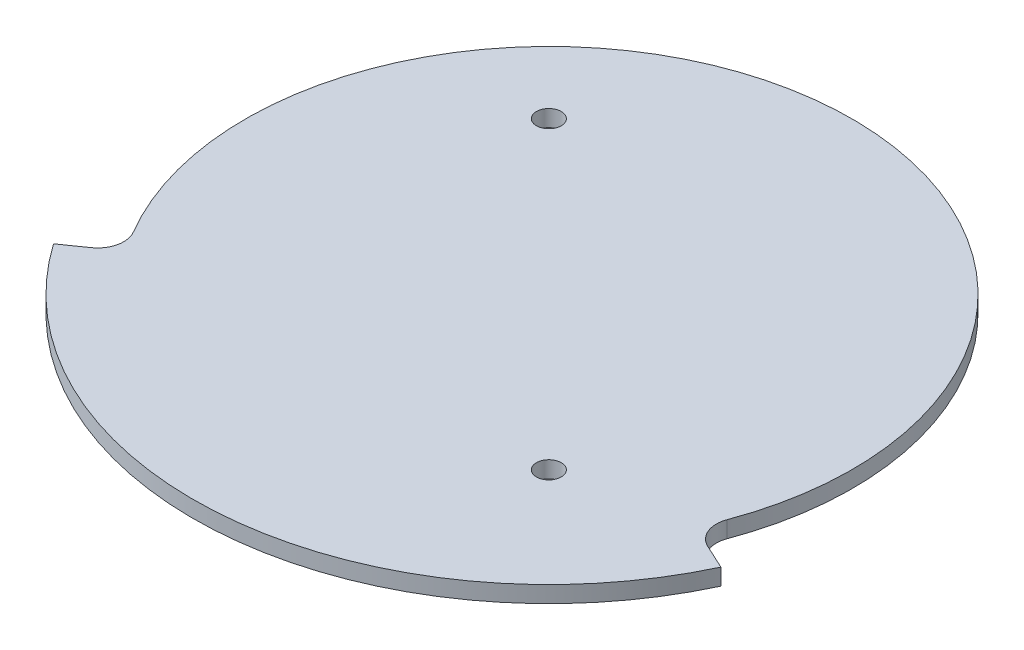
ISO-10303-21;
HEADER;
FILE_DESCRIPTION(('STEP AP214'),'2;1');
FILE_NAME('part.step','',(''),(''),'','','');
FILE_SCHEMA(('AUTOMOTIVE_DESIGN { 1 0 10303 214 1 1 1 1 }'));
ENDSEC;
DATA;
#1=APPLICATION_CONTEXT('core data for automotive mechanical design processes');
#2=APPLICATION_PROTOCOL_DEFINITION('international standard','automotive_design',2000,#1);
#3=PRODUCT_CONTEXT('',#1,'mechanical');
#4=PRODUCT('Part','Part','',(#3));
#5=PRODUCT_RELATED_PRODUCT_CATEGORY('part','',(#4));
#6=PRODUCT_DEFINITION_FORMATION('','',#4);
#7=PRODUCT_DEFINITION_CONTEXT('part definition',#1,'design');
#8=PRODUCT_DEFINITION('design','',#6,#7);
#9=PRODUCT_DEFINITION_SHAPE('','',#8);
#10=(LENGTH_UNIT() NAMED_UNIT(*) SI_UNIT(.MILLI.,.METRE.));
#11=(NAMED_UNIT(*) PLANE_ANGLE_UNIT() SI_UNIT($,.RADIAN.));
#12=(NAMED_UNIT(*) SI_UNIT($,.STERADIAN.) SOLID_ANGLE_UNIT());
#13=UNCERTAINTY_MEASURE_WITH_UNIT(LENGTH_MEASURE(1.E-05),#10,'distance_accuracy_value','');
#14=(GEOMETRIC_REPRESENTATION_CONTEXT(3) GLOBAL_UNCERTAINTY_ASSIGNED_CONTEXT((#13)) GLOBAL_UNIT_ASSIGNED_CONTEXT((#10,
#11,#12)) REPRESENTATION_CONTEXT('',''));
#15=CARTESIAN_POINT('',(0.,0.,0.));
#16=DIRECTION('',(0.,0.,1.));
#17=DIRECTION('',(1.,0.,0.));
#18=AXIS2_PLACEMENT_3D('',#15,#16,#17);
#19=CARTESIAN_POINT('',(0.,6.35,0.));
#20=DIRECTION('',(0.,-1.,0.));
#21=DIRECTION('',(0.,0.,-1.));
#22=AXIS2_PLACEMENT_3D('',#19,#20,#21);
#23=CYLINDRICAL_SURFACE('',#22,136.5);
#24=CARTESIAN_POINT('',(0.,0.,0.));
#25=DIRECTION('',(0.,1.,0.));
#26=DIRECTION('',(0.,0.,1.));
#27=AXIS2_PLACEMENT_3D('',#24,#25,#26);
#28=CIRCLE('',#27,136.5);
#29=CARTESIAN_POINT('',(-111.814254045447,0.,78.293183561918));
#30=VERTEX_POINT('',#29);
#31=CARTESIAN_POINT('',(123.711012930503,0.,57.6873927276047));
#32=VERTEX_POINT('',#31);
#33=EDGE_CURVE('E38',#30,#32,#28,.T.);
#34=ORIENTED_EDGE('',*,*,#33,.T.);
#35=DIRECTION('',(0.,1.,0.));
#36=VECTOR('',#35,1.);
#37=CARTESIAN_POINT('',(123.711012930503,0.,57.6873927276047));
#38=LINE('',#37,#36);
#39=CARTESIAN_POINT('',(123.711012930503,6.35,57.6873927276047));
#40=VERTEX_POINT('',#39);
#41=EDGE_CURVE('E59',#32,#40,#38,.T.);
#42=ORIENTED_EDGE('',*,*,#41,.T.);
#43=CARTESIAN_POINT('',(0.,6.35,0.));
#44=DIRECTION('',(0.,1.,0.));
#45=DIRECTION('',(0.,0.,1.));
#46=AXIS2_PLACEMENT_3D('',#43,#44,#45);
#47=CIRCLE('',#46,136.5);
#48=CARTESIAN_POINT('',(-111.814254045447,6.35,78.293183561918));
#49=VERTEX_POINT('',#48);
#50=EDGE_CURVE('E11',#49,#40,#47,.T.);
#51=ORIENTED_EDGE('',*,*,#50,.F.);
#52=DIRECTION('',(0.,1.,0.));
#53=VECTOR('',#52,1.);
#54=CARTESIAN_POINT('',(-111.814254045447,0.,78.293183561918));
#55=LINE('',#54,#53);
#56=EDGE_CURVE('E120',#30,#49,#55,.T.);
#57=ORIENTED_EDGE('',*,*,#56,.F.);
#58=EDGE_LOOP('',(#34,#42,#51,#57));
#59=FACE_BOUND('',#58,.T.);
#60=ADVANCED_FACE('F35',(#59),#23,.T.);
#61=CARTESIAN_POINT('',(0.,6.35,0.));
#62=DIRECTION('',(0.,1.,0.));
#63=DIRECTION('',(0.,0.,1.));
#64=AXIS2_PLACEMENT_3D('',#61,#62,#63);
#65=PLANE('',#64);
#66=CARTESIAN_POINT('',(-58.3716647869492,6.35,-58.3716647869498));
#67=DIRECTION('',(0.,1.,0.));
#68=DIRECTION('',(0.,0.,1.));
#69=AXIS2_PLACEMENT_3D('',#66,#67,#68);
#70=CIRCLE('',#69,4.76249999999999);
#71=CARTESIAN_POINT('',(-58.3716647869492,6.35,-53.6091647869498));
#72=VERTEX_POINT('',#71);
#73=EDGE_CURVE('E251',#72,#72,#70,.T.);
#74=ORIENTED_EDGE('',*,*,#73,.F.);
#75=EDGE_LOOP('',(#74));
#76=FACE_BOUND('',#75,.T.);
#77=CARTESIAN_POINT('',(58.3716647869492,6.35,58.3716647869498));
#78=DIRECTION('',(0.,1.,0.));
#79=DIRECTION('',(0.,0.,1.));
#80=AXIS2_PLACEMENT_3D('',#77,#78,#79);
#81=CIRCLE('',#80,4.76249999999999);
#82=CARTESIAN_POINT('',(58.3716647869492,6.35,63.1341647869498));
#83=VERTEX_POINT('',#82);
#84=EDGE_CURVE('E240',#83,#83,#81,.T.);
#85=ORIENTED_EDGE('',*,*,#84,.F.);
#86=EDGE_LOOP('',(#85));
#87=FACE_BOUND('',#86,.T.);
#88=DIRECTION('',(0.906307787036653,0.,0.422618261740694));
#89=VECTOR('',#88,1.);
#90=CARTESIAN_POINT('',(114.289149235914,6.35,53.2939055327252));
#91=LINE('',#90,#89);
#92=CARTESIAN_POINT('',(114.289149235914,6.35,53.2939055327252));
#93=VERTEX_POINT('',#92);
#94=EDGE_CURVE('E82',#93,#40,#91,.T.);
#95=ORIENTED_EDGE('',*,*,#94,.F.);
#96=CARTESIAN_POINT('',(118.515331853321,6.35,44.2308276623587));
#97=DIRECTION('',(0.,1.,0.));
#98=DIRECTION('',(0.,0.,1.));
#99=AXIS2_PLACEMENT_3D('',#96,#97,#98);
#100=CIRCLE('',#99,10.);
#101=CARTESIAN_POINT('',(109.146530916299,6.35,40.7343195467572));
#102=VERTEX_POINT('',#101);
#103=EDGE_CURVE('E129',#102,#93,#100,.T.);
#104=ORIENTED_EDGE('',*,*,#103,.F.);
#105=CARTESIAN_POINT('',(0.,6.35,0.));
#106=DIRECTION('',(0.,-1.,0.));
#107=DIRECTION('',(0.,0.,1.));
#108=AXIS2_PLACEMENT_3D('',#105,#106,#107);
#109=CIRCLE('',#108,116.5);
#110=CARTESIAN_POINT('',(-100.414909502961,6.35,59.0685698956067));
#111=VERTEX_POINT('',#110);
#112=EDGE_CURVE('E101',#111,#102,#109,.T.);
#113=ORIENTED_EDGE('',*,*,#112,.F.);
#114=CARTESIAN_POINT('',(-109.034215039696,6.35,64.1388334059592));
#115=DIRECTION('',(0.,1.,0.));
#116=DIRECTION('',(0.,0.,1.));
#117=AXIS2_PLACEMENT_3D('',#114,#115,#116);
#118=CIRCLE('',#117,10.);
#119=CARTESIAN_POINT('',(-103.298450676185,6.35,72.3303538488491));
#120=VERTEX_POINT('',#119);
#121=EDGE_CURVE('E124',#120,#111,#118,.T.);
#122=ORIENTED_EDGE('',*,*,#121,.F.);
#123=DIRECTION('',(0.819152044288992,0.,-0.573576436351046));
#124=VECTOR('',#123,1.);
#125=CARTESIAN_POINT('',(-103.298450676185,6.35,72.3303538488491));
#126=LINE('',#125,#124);
#127=EDGE_CURVE('E121',#49,#120,#126,.T.);
#128=ORIENTED_EDGE('',*,*,#127,.F.);
#129=ORIENTED_EDGE('',*,*,#50,.T.);
#130=EDGE_LOOP('',(#95,#104,#113,#122,#128,#129));
#131=FACE_BOUND('',#130,.T.);
#132=ADVANCED_FACE('F145',(#76,#87,#131),#65,.T.);
#133=CARTESIAN_POINT('',(0.,0.,0.));
#134=DIRECTION('',(0.,1.,0.));
#135=DIRECTION('',(0.,0.,1.));
#136=AXIS2_PLACEMENT_3D('',#133,#134,#135);
#137=PLANE('',#136);
#138=CARTESIAN_POINT('',(-58.3716647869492,0.,-58.3716647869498));
#139=DIRECTION('',(0.,1.,0.));
#140=DIRECTION('',(0.,0.,1.));
#141=AXIS2_PLACEMENT_3D('',#138,#139,#140);
#142=CIRCLE('',#141,4.76249999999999);
#143=CARTESIAN_POINT('',(-58.3716647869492,0.,-53.6091647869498));
#144=VERTEX_POINT('',#143);
#145=EDGE_CURVE('E243',#144,#144,#142,.F.);
#146=ORIENTED_EDGE('',*,*,#145,.F.);
#147=EDGE_LOOP('',(#146));
#148=FACE_BOUND('',#147,.T.);
#149=CARTESIAN_POINT('',(58.3716647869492,0.,58.3716647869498));
#150=DIRECTION('',(0.,1.,0.));
#151=DIRECTION('',(0.,0.,1.));
#152=AXIS2_PLACEMENT_3D('',#149,#150,#151);
#153=CIRCLE('',#152,4.76249999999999);
#154=CARTESIAN_POINT('',(58.3716647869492,0.,63.1341647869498));
#155=VERTEX_POINT('',#154);
#156=EDGE_CURVE('E125',#155,#155,#153,.F.);
#157=ORIENTED_EDGE('',*,*,#156,.F.);
#158=EDGE_LOOP('',(#157));
#159=FACE_BOUND('',#158,.T.);
#160=CARTESIAN_POINT('',(118.515331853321,0.,44.2308276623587));
#161=DIRECTION('',(0.,1.,0.));
#162=DIRECTION('',(0.,0.,1.));
#163=AXIS2_PLACEMENT_3D('',#160,#161,#162);
#164=CIRCLE('',#163,10.);
#165=CARTESIAN_POINT('',(109.146530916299,0.,40.7343195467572));
#166=VERTEX_POINT('',#165);
#167=CARTESIAN_POINT('',(114.289149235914,0.,53.2939055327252));
#168=VERTEX_POINT('',#167);
#169=EDGE_CURVE('E109',#166,#168,#164,.T.);
#170=ORIENTED_EDGE('',*,*,#169,.T.);
#171=DIRECTION('',(0.906307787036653,0.,0.422618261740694));
#172=VECTOR('',#171,1.);
#173=CARTESIAN_POINT('',(114.289149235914,0.,53.2939055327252));
#174=LINE('',#173,#172);
#175=EDGE_CURVE('E112',#168,#32,#174,.T.);
#176=ORIENTED_EDGE('',*,*,#175,.T.);
#177=ORIENTED_EDGE('',*,*,#33,.F.);
#178=DIRECTION('',(0.819152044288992,0.,-0.573576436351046));
#179=VECTOR('',#178,1.);
#180=CARTESIAN_POINT('',(-103.298450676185,0.,72.3303538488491));
#181=LINE('',#180,#179);
#182=CARTESIAN_POINT('',(-103.298450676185,0.,72.3303538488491));
#183=VERTEX_POINT('',#182);
#184=EDGE_CURVE('E88',#30,#183,#181,.T.);
#185=ORIENTED_EDGE('',*,*,#184,.T.);
#186=CARTESIAN_POINT('',(-109.034215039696,0.,64.1388334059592));
#187=DIRECTION('',(0.,1.,0.));
#188=DIRECTION('',(0.,0.,1.));
#189=AXIS2_PLACEMENT_3D('',#186,#187,#188);
#190=CIRCLE('',#189,10.);
#191=CARTESIAN_POINT('',(-100.414909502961,0.,59.0685698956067));
#192=VERTEX_POINT('',#191);
#193=EDGE_CURVE('E50',#183,#192,#190,.T.);
#194=ORIENTED_EDGE('',*,*,#193,.T.);
#195=CARTESIAN_POINT('',(0.,0.,0.));
#196=DIRECTION('',(0.,-1.,0.));
#197=DIRECTION('',(0.,0.,1.));
#198=AXIS2_PLACEMENT_3D('',#195,#196,#197);
#199=CIRCLE('',#198,116.5);
#200=EDGE_CURVE('E99',#192,#166,#199,.T.);
#201=ORIENTED_EDGE('',*,*,#200,.T.);
#202=EDGE_LOOP('',(#170,#176,#177,#185,#194,#201));
#203=FACE_BOUND('',#202,.T.);
#204=ADVANCED_FACE('F114',(#148,#159,#203),#137,.F.);
#205=CARTESIAN_POINT('',(114.289149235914,0.,53.2939055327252));
#206=DIRECTION('',(-0.422618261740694,0.,0.906307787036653));
#207=DIRECTION('',(0.906307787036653,0.,0.422618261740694));
#208=AXIS2_PLACEMENT_3D('',#205,#206,#207);
#209=PLANE('',#208);
#210=ORIENTED_EDGE('',*,*,#94,.T.);
#211=ORIENTED_EDGE('',*,*,#41,.F.);
#212=ORIENTED_EDGE('',*,*,#175,.F.);
#213=DIRECTION('',(0.,1.,0.));
#214=VECTOR('',#213,1.);
#215=CARTESIAN_POINT('',(114.289149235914,0.,53.2939055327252));
#216=LINE('',#215,#214);
#217=EDGE_CURVE('E105',#168,#93,#216,.T.);
#218=ORIENTED_EDGE('',*,*,#217,.T.);
#219=EDGE_LOOP('',(#210,#211,#212,#218));
#220=FACE_BOUND('',#219,.T.);
#221=ADVANCED_FACE('F146',(#220),#209,.F.);
#222=CARTESIAN_POINT('',(118.515331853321,0.,44.2308276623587));
#223=DIRECTION('',(0.,1.,0.));
#224=DIRECTION('',(0.,0.,1.));
#225=AXIS2_PLACEMENT_3D('',#222,#223,#224);
#226=CYLINDRICAL_SURFACE('',#225,10.);
#227=ORIENTED_EDGE('',*,*,#103,.T.);
#228=ORIENTED_EDGE('',*,*,#217,.F.);
#229=ORIENTED_EDGE('',*,*,#169,.F.);
#230=DIRECTION('',(0.,1.,0.));
#231=VECTOR('',#230,1.);
#232=CARTESIAN_POINT('',(109.146530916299,0.,40.7343195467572));
#233=LINE('',#232,#231);
#234=EDGE_CURVE('E95',#166,#102,#233,.T.);
#235=ORIENTED_EDGE('',*,*,#234,.T.);
#236=EDGE_LOOP('',(#227,#228,#229,#235));
#237=FACE_BOUND('',#236,.T.);
#238=ADVANCED_FACE('F110',(#237),#226,.F.);
#239=CARTESIAN_POINT('',(0.,0.,0.));
#240=DIRECTION('',(0.,1.,0.));
#241=DIRECTION('',(0.,0.,1.));
#242=AXIS2_PLACEMENT_3D('',#239,#240,#241);
#243=CYLINDRICAL_SURFACE('',#242,116.5);
#244=ORIENTED_EDGE('',*,*,#112,.T.);
#245=ORIENTED_EDGE('',*,*,#234,.F.);
#246=ORIENTED_EDGE('',*,*,#200,.F.);
#247=DIRECTION('',(0.,1.,0.));
#248=VECTOR('',#247,1.);
#249=CARTESIAN_POINT('',(-100.414909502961,0.,59.0685698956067));
#250=LINE('',#249,#248);
#251=EDGE_CURVE('E106',#192,#111,#250,.T.);
#252=ORIENTED_EDGE('',*,*,#251,.T.);
#253=EDGE_LOOP('',(#244,#245,#246,#252));
#254=FACE_BOUND('',#253,.T.);
#255=ADVANCED_FACE('F97',(#254),#243,.T.);
#256=CARTESIAN_POINT('',(-109.034215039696,0.,64.1388334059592));
#257=DIRECTION('',(0.,1.,0.));
#258=DIRECTION('',(0.,0.,1.));
#259=AXIS2_PLACEMENT_3D('',#256,#257,#258);
#260=CYLINDRICAL_SURFACE('',#259,10.);
#261=ORIENTED_EDGE('',*,*,#121,.T.);
#262=ORIENTED_EDGE('',*,*,#251,.F.);
#263=ORIENTED_EDGE('',*,*,#193,.F.);
#264=DIRECTION('',(0.,1.,0.));
#265=VECTOR('',#264,1.);
#266=CARTESIAN_POINT('',(-103.298450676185,0.,72.3303538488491));
#267=LINE('',#266,#265);
#268=EDGE_CURVE('E135',#183,#120,#267,.T.);
#269=ORIENTED_EDGE('',*,*,#268,.T.);
#270=EDGE_LOOP('',(#261,#262,#263,#269));
#271=FACE_BOUND('',#270,.T.);
#272=ADVANCED_FACE('F170',(#271),#260,.F.);
#273=CARTESIAN_POINT('',(-103.298450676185,0.,72.3303538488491));
#274=DIRECTION('',(0.573576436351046,0.,0.819152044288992));
#275=DIRECTION('',(0.819152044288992,0.,-0.573576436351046));
#276=AXIS2_PLACEMENT_3D('',#273,#274,#275);
#277=PLANE('',#276);
#278=ORIENTED_EDGE('',*,*,#127,.T.);
#279=ORIENTED_EDGE('',*,*,#268,.F.);
#280=ORIENTED_EDGE('',*,*,#184,.F.);
#281=ORIENTED_EDGE('',*,*,#56,.T.);
#282=EDGE_LOOP('',(#278,#279,#280,#281));
#283=FACE_BOUND('',#282,.T.);
#284=ADVANCED_FACE('F138',(#283),#277,.F.);
#285=CARTESIAN_POINT('',(58.3716647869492,-0.00100000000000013,58.3716647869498));
#286=DIRECTION('',(0.,1.,0.));
#287=DIRECTION('',(0.,0.,1.));
#288=AXIS2_PLACEMENT_3D('',#285,#286,#287);
#289=CYLINDRICAL_SURFACE('',#288,4.76249999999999);
#290=ORIENTED_EDGE('',*,*,#84,.T.);
#291=EDGE_LOOP('',(#290));
#292=FACE_BOUND('',#291,.T.);
#293=ORIENTED_EDGE('',*,*,#156,.T.);
#294=EDGE_LOOP('',(#293));
#295=FACE_BOUND('',#294,.T.);
#296=ADVANCED_FACE('F169',(#292,#295),#289,.F.);
#297=CARTESIAN_POINT('',(-58.3716647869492,-0.00100000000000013,-58.3716647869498));
#298=DIRECTION('',(0.,1.,0.));
#299=DIRECTION('',(0.,0.,1.));
#300=AXIS2_PLACEMENT_3D('',#297,#298,#299);
#301=CYLINDRICAL_SURFACE('',#300,4.76249999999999);
#302=ORIENTED_EDGE('',*,*,#73,.T.);
#303=EDGE_LOOP('',(#302));
#304=FACE_BOUND('',#303,.T.);
#305=ORIENTED_EDGE('',*,*,#145,.T.);
#306=EDGE_LOOP('',(#305));
#307=FACE_BOUND('',#306,.T.);
#308=ADVANCED_FACE('F193',(#304,#307),#301,.F.);
#309=CLOSED_SHELL('',(#60,#132,#204,#221,#238,#255,#272,#284,#296,#308));
#310=MANIFOLD_SOLID_BREP('B2',#309);
#311=ADVANCED_BREP_SHAPE_REPRESENTATION('',(#18,#310),#14);
#312=SHAPE_DEFINITION_REPRESENTATION(#9,#311);
ENDSEC;
END-ISO-10303-21;
